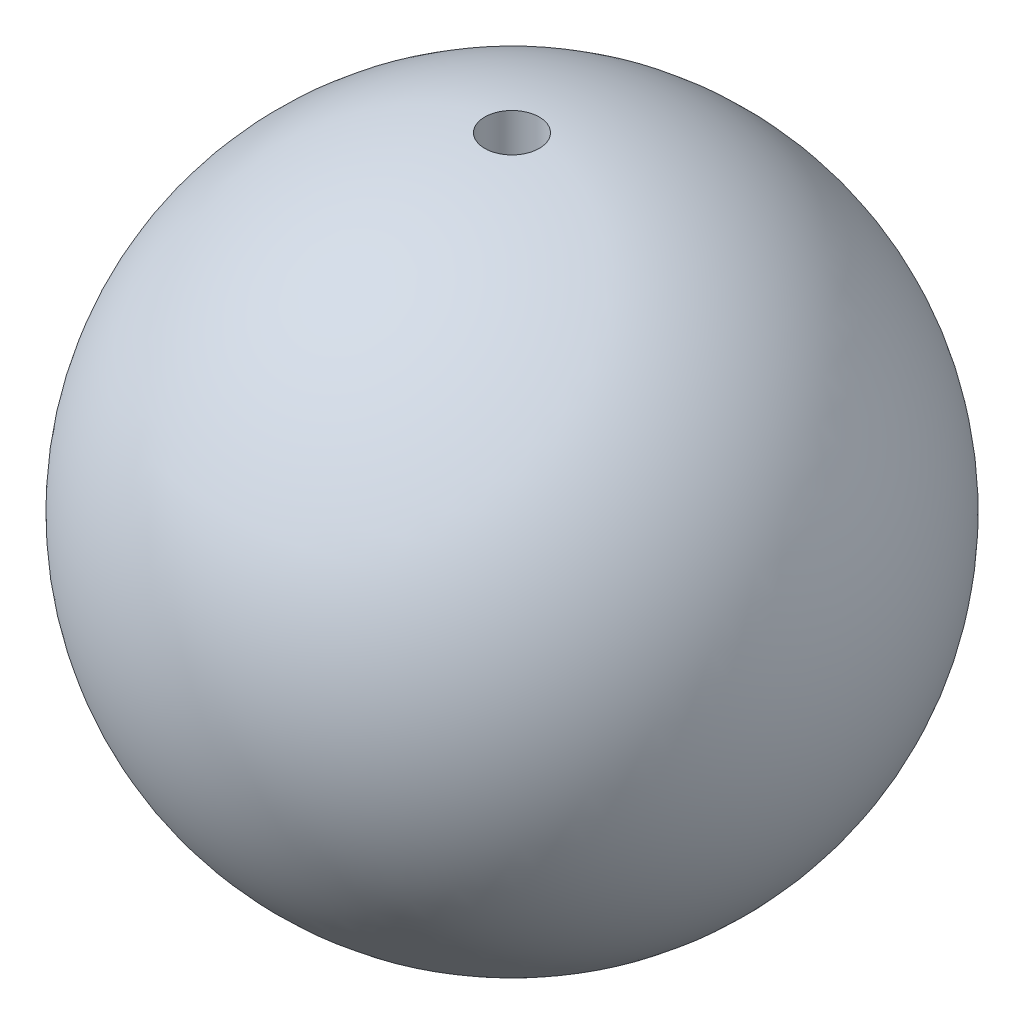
from build123d import *

# Parameters (mm, degrees)
SKETCH2_R  = 1.5748
HOLE_DEPTH = 33.995567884


with BuildPart() as part:
    # Sketch1 → Revolve1 (revolve)
    with BuildSketch(Plane.XY):
        with BuildLine():
            Line((0, 19.05), (0, -19.05))
            ThreePointArc((0, -19.05), (19.05, 0), (0, 19.05))
        make_face()
    revolve(axis=Axis((0, 19.05, 0), (0, -1, 0)))

    # Sketch2 → Hole (cut, through all)
    with BuildSketch(Plane(origin=(0, 0, 0), x_dir=(1, 0, 0), z_dir=(0, 1, 0))):
        with Locations(Location((0, 0, 0), (0, 0, 90))):
            Circle(SKETCH2_R)
    extrude(amount=HOLE_DEPTH, mode=Mode.SUBTRACT)


solid = part.part
